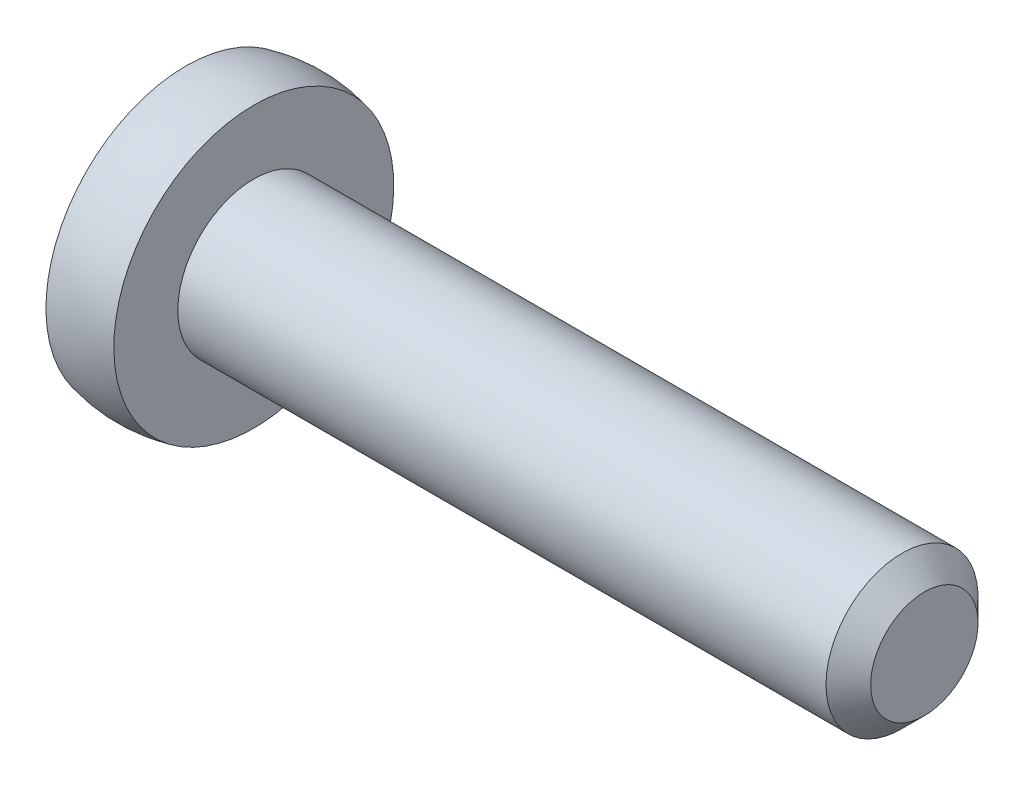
from build123d import *

# Parameters (mm, degrees)
EXTRUDE3_START = -1.016
EXTRUDE3_DEPTH = 1.905
EXTRUDE3_TAPER = 11
SKETCH6_R      = 2.159
EXTRUDE4_DEPTH = 19.05
CHAMFER1_SIZE  = 0.635


with BuildPart() as part:
    # Sketch1 → Revolve1 (revolve)
    with BuildSketch(Plane.XY):
        with BuildLine():
            Line((2.205747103, 0), (2.205747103, 3.975875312))
            ThreePointArc((2.205747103, 3.975875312), (1.241484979, 4.091135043), (0.277222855, 3.975875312))
            ThreePointArc((0.277222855, 3.975875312), (-0.557046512, 2.065236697), (-0.842252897, 0))
            Line((-0.842252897, 0), (2.205747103, 0))
        make_face()
    revolve(axis=Axis((9.077037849, 0, 0), (-1, 0, 0)))

    # Sketch2 → Extrude3 (cut)
    with BuildSketch(Plane(origin=(0, 0, 0), x_dir=(0, 0, -1), z_dir=(1, 0, 0)).offset(EXTRUDE3_START)):
        Polygon((-2.54, 0.508), (-2.54, -0.508), (-1.016, -0.508), (-0.508, -0.508), (-0.508, -1.016), (-0.508, -2.54), (0.508, -2.54), (0.508, -1.016), (0.508, -0.508), (1.016, -0.508), (2.54, -0.508), (2.54, 0.508), (1.016, 0.508), (0.508, 0.508), (0.508, 1.016), (0.508, 2.54), (-0.508, 2.54), (-0.508, 1.016), (-0.508, 0.508), (-1.016, 0.508), align=None)
    extrude(amount=EXTRUDE3_DEPTH, taper=EXTRUDE3_TAPER, mode=Mode.SUBTRACT)

    # Sketch6 → Extrude4 (add)
    with BuildSketch(Plane(origin=(2.205747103, 0, 0), x_dir=(0, 0, -1), z_dir=(1, 0, 0))):
        with Locations(Location((0, 0, 0), (0, 0, 180))):
            Circle(SKETCH6_R)
    extrude(amount=EXTRUDE4_DEPTH)

    # Chamfer1
    chamfer1_edges = [part.edges().sort_by_distance(p)[0] for p in [
        (21.255747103, 0, -2.159),
    ]]
    chamfer(chamfer1_edges, length=CHAMFER1_SIZE)


solid = part.part
